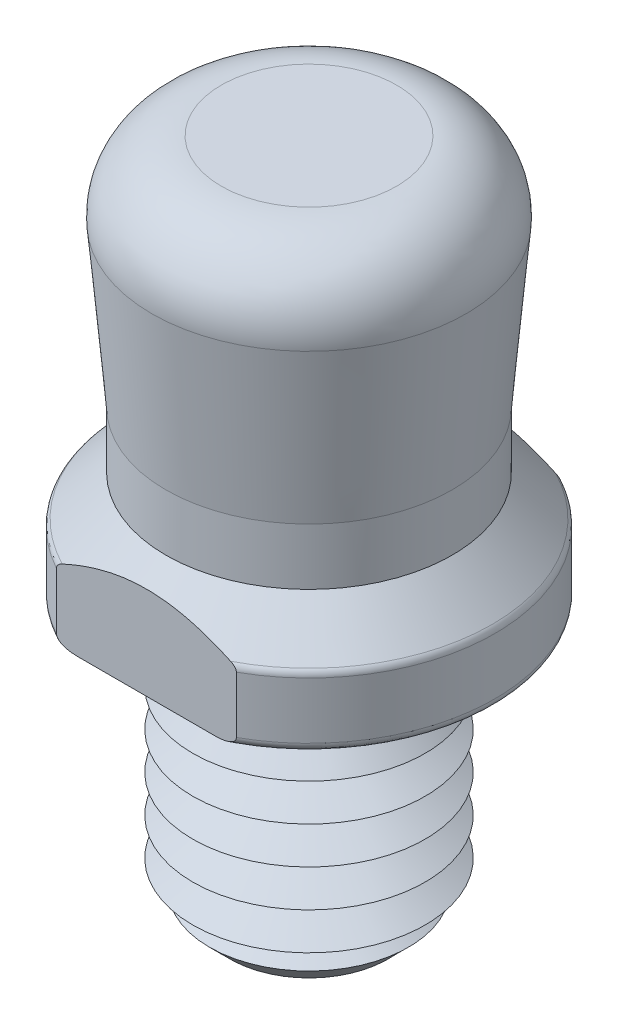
from build123d import *

# Parameters (mm, degrees)
CUT_EXTRUDE1_DEPTH = 2
CHAMFER2_SIZE      = 0.8
LPATTERN1_COUNT    = 6
LPATTERN1_PITCH    = 0.8


with BuildPart() as part:
    # Sketch2 → Revolve1 (revolve)
    with BuildSketch(Plane(origin=(0, 0, 0), x_dir=(0, 0, -1), z_dir=(1, 0, 0))):
        with BuildLine():
            Line((0, 0), (-3.8, 0))
            ThreePointArc((-3.8, 0), (-3.941421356, 0.058578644), (-4, 0.2))
            Line((-4, 0.2), (-4, 1.417157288))
            ThreePointArc((-4, 1.417157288), (-3.984775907, 1.493693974), (-3.941421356, 1.558578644))
            Line((-3.941421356, 1.558578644), (-3.080761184, 2.419238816))
            Line((-3.080761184, 2.419238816), (-3.080761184, 3.636396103))
            Line((-3.080761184, 3.636396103), (-3.381098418, 7.069266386))
            ThreePointArc((-3.381098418, 7.069266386), (-2.992722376, 8.213385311), (-1.88680637, 8.7))
            Line((-1.88680637, 8.7), (0, 8.7))
            Line((0, 8.7), (0, 0))
        make_face()
    revolve(axis=Axis((0, 69.540327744, 0), (0, -1, 0)))

    # Sketch4 → Cut-Extrude1 (cut)
    with BuildSketch(Plane(origin=(0, 0, 0), x_dir=(1, 0, 0), z_dir=(0, 1, 0))):
        with BuildLine():
            Line((-2.04814985, -3.5), (2.04814985, -3.5))
            ThreePointArc((2.04814985, -3.5), (0, -4.055233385), (-2.04814985, -3.5))
        make_face()
        with BuildLine():
            Line((2.04814985, 3.5), (-2.04814985, 3.5))
            ThreePointArc((-2.04814985, 3.5), (0, 4.055233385), (2.04814985, 3.5))
        make_face()
    extrude(amount=CUT_EXTRUDE1_DEPTH, mode=Mode.SUBTRACT)

    # Sketch5 → Revolve3 (revolve)
    with BuildSketch(Plane(origin=(0, 0, 0), x_dir=(0, 0, -1), z_dir=(1, 0, 0))):
        Polygon((0, 0), (-1.934314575, 0), (-1.934314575, -1), (-2.5, -1.565685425), (-2.5, -5.8), (0, -5.8), align=None)
    revolve(axis=Axis((0, 69.540327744, 0), (0, -1, 0)))

    # Chamfer2
    chamfer2_edges = [part.edges().sort_by_distance(p)[0] for p in [
        (0, -5.8, -2.5),
    ]]
    chamfer(chamfer2_edges, length=CHAMFER2_SIZE)

    # Sketch6 → Cut-Revolve1 (revolve, cut)
    with BuildSketch(Plane(origin=(0, 0, 0), x_dir=(0, 0, -1), z_dir=(1, 0, 0))):
        Polygon((-2.5, -1.565685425), (-1.807179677, -1.965685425), (-2.5, -2.365685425), align=None)
    cut_revolve1 = revolve(axis=Axis((0, 69.540327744, 0), (0, -1, 0)), mode=Mode.SUBTRACT)

    # LPattern1: Cut-Revolve1 ×6
    with Locations(*[(0, -i * LPATTERN1_PITCH, 0) for i in range(1, LPATTERN1_COUNT)]):
        add(cut_revolve1, mode=Mode.SUBTRACT)


solid = part.part
